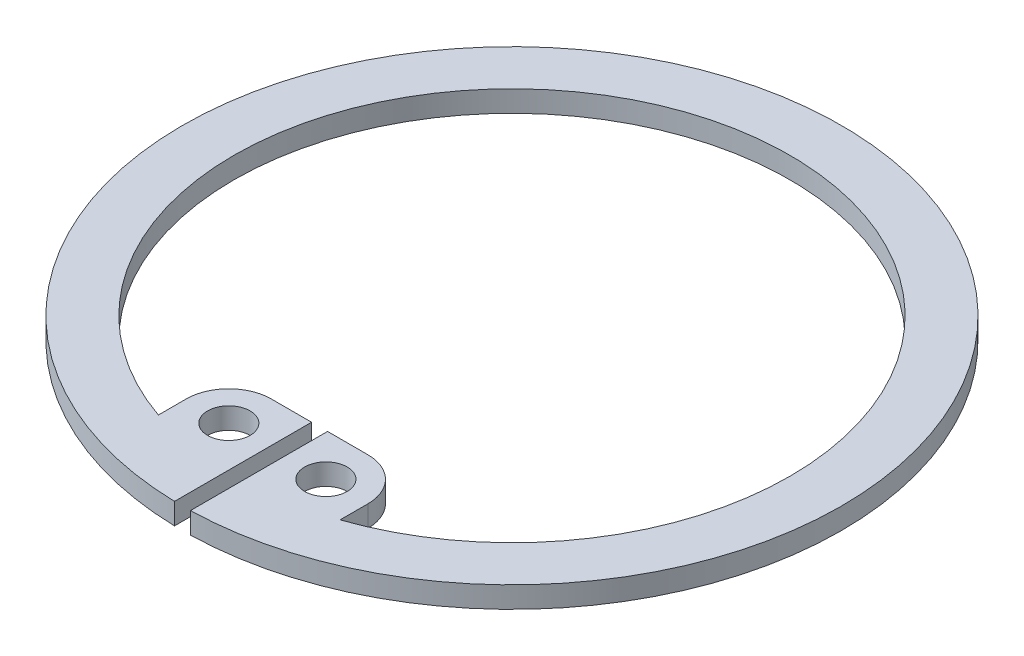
ISO-10303-21;
HEADER;
FILE_DESCRIPTION(('STEP AP214'),'2;1');
FILE_NAME('part.step','',(''),(''),'','','');
FILE_SCHEMA(('AUTOMOTIVE_DESIGN { 1 0 10303 214 1 1 1 1 }'));
ENDSEC;
DATA;
#1=APPLICATION_CONTEXT('core data for automotive mechanical design processes');
#2=APPLICATION_PROTOCOL_DEFINITION('international standard','automotive_design',2000,#1);
#3=PRODUCT_CONTEXT('',#1,'mechanical');
#4=PRODUCT('Part','Part','',(#3));
#5=PRODUCT_RELATED_PRODUCT_CATEGORY('part','',(#4));
#6=PRODUCT_DEFINITION_FORMATION('','',#4);
#7=PRODUCT_DEFINITION_CONTEXT('part definition',#1,'design');
#8=PRODUCT_DEFINITION('design','',#6,#7);
#9=PRODUCT_DEFINITION_SHAPE('','',#8);
#10=(LENGTH_UNIT() NAMED_UNIT(*) SI_UNIT(.MILLI.,.METRE.));
#11=(NAMED_UNIT(*) PLANE_ANGLE_UNIT() SI_UNIT($,.RADIAN.));
#12=(NAMED_UNIT(*) SI_UNIT($,.STERADIAN.) SOLID_ANGLE_UNIT());
#13=UNCERTAINTY_MEASURE_WITH_UNIT(LENGTH_MEASURE(1.E-05),#10,'distance_accuracy_value','');
#14=(GEOMETRIC_REPRESENTATION_CONTEXT(3) GLOBAL_UNCERTAINTY_ASSIGNED_CONTEXT((#13)) GLOBAL_UNIT_ASSIGNED_CONTEXT((#10,
#11,#12)) REPRESENTATION_CONTEXT('',''));
#15=CARTESIAN_POINT('',(0.,0.,0.));
#16=DIRECTION('',(0.,0.,1.));
#17=DIRECTION('',(1.,0.,0.));
#18=AXIS2_PLACEMENT_3D('',#15,#16,#17);
#19=CARTESIAN_POINT('',(0.,4.,0.));
#20=DIRECTION('',(0.,1.,0.));
#21=DIRECTION('',(0.,0.,1.));
#22=AXIS2_PLACEMENT_3D('',#19,#20,#21);
#23=PLANE('',#22);
#24=CARTESIAN_POINT('',(9.13387792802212,4.,44.1290912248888));
#25=DIRECTION('',(0.,1.,0.));
#26=DIRECTION('',(0.,0.,-1.));
#27=AXIS2_PLACEMENT_3D('',#24,#25,#26);
#28=CIRCLE('',#27,4.);
#29=CARTESIAN_POINT('',(9.13387792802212,4.,40.1290912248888));
#30=VERTEX_POINT('',#29);
#31=EDGE_CURVE('E152',#30,#30,#28,.T.);
#32=ORIENTED_EDGE('',*,*,#31,.F.);
#33=EDGE_LOOP('',(#32));
#34=FACE_BOUND('',#33,.T.);
#35=DIRECTION('',(0.,0.,-1.));
#36=VECTOR('',#35,1.);
#37=CARTESIAN_POINT('',(17.086811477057,4.,49.4300604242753));
#38=LINE('',#37,#36);
#39=CARTESIAN_POINT('',(17.086811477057,4.,49.4300604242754));
#40=VERTEX_POINT('',#39);
#41=CARTESIAN_POINT('',(17.086811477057,4.,44.1930357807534));
#42=VERTEX_POINT('',#41);
#43=EDGE_CURVE('E120',#40,#42,#38,.T.);
#44=ORIENTED_EDGE('',*,*,#43,.T.);
#45=CARTESIAN_POINT('',(9.08681147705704,4.,44.1930357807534));
#46=DIRECTION('',(0.,1.,0.));
#47=DIRECTION('',(0.,0.,1.));
#48=AXIS2_PLACEMENT_3D('',#45,#46,#47);
#49=CIRCLE('',#48,8.);
#50=CARTESIAN_POINT('',(9.08681147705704,4.,36.1930357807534));
#51=VERTEX_POINT('',#50);
#52=EDGE_CURVE('E116',#42,#51,#49,.T.);
#53=ORIENTED_EDGE('',*,*,#52,.T.);
#54=DIRECTION('',(-1.,0.,0.));
#55=VECTOR('',#54,1.);
#56=CARTESIAN_POINT('',(17.086811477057,4.,36.1930357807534));
#57=LINE('',#56,#55);
#58=CARTESIAN_POINT('',(1.49999999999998,4.,36.1930357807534));
#59=VERTEX_POINT('',#58);
#60=EDGE_CURVE('E108',#51,#59,#57,.T.);
#61=ORIENTED_EDGE('',*,*,#60,.T.);
#62=DIRECTION('',(0.,0.,1.));
#63=VECTOR('',#62,1.);
#64=CARTESIAN_POINT('',(1.49999999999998,4.,61.9818521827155));
#65=LINE('',#64,#63);
#66=CARTESIAN_POINT('',(1.49999999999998,4.,61.9818521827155));
#67=VERTEX_POINT('',#66);
#68=EDGE_CURVE('E113',#59,#67,#65,.T.);
#69=ORIENTED_EDGE('',*,*,#68,.T.);
#70=CARTESIAN_POINT('',(0.,4.,0.));
#71=DIRECTION('',(0.,1.,0.));
#72=DIRECTION('',(0.,0.,1.));
#73=AXIS2_PLACEMENT_3D('',#70,#71,#72);
#74=CIRCLE('',#73,62.);
#75=CARTESIAN_POINT('',(-1.5,4.,61.9818521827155));
#76=VERTEX_POINT('',#75);
#77=EDGE_CURVE('E135',#67,#76,#74,.T.);
#78=ORIENTED_EDGE('',*,*,#77,.T.);
#79=DIRECTION('',(0.,0.,-1.));
#80=VECTOR('',#79,1.);
#81=CARTESIAN_POINT('',(-1.49999999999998,4.,61.9818521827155));
#82=LINE('',#81,#80);
#83=CARTESIAN_POINT('',(-1.49999999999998,4.,36.1930357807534));
#84=VERTEX_POINT('',#83);
#85=EDGE_CURVE('E137',#76,#84,#82,.T.);
#86=ORIENTED_EDGE('',*,*,#85,.T.);
#87=DIRECTION('',(-1.,0.,0.));
#88=VECTOR('',#87,1.);
#89=CARTESIAN_POINT('',(-17.086811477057,4.,36.1930357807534));
#90=LINE('',#89,#88);
#91=CARTESIAN_POINT('',(-9.08681147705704,4.,36.1930357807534));
#92=VERTEX_POINT('',#91);
#93=EDGE_CURVE('E142',#84,#92,#90,.T.);
#94=ORIENTED_EDGE('',*,*,#93,.T.);
#95=CARTESIAN_POINT('',(-9.08681147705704,4.,44.1930357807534));
#96=DIRECTION('',(0.,1.,0.));
#97=DIRECTION('',(0.,0.,1.));
#98=AXIS2_PLACEMENT_3D('',#95,#96,#97);
#99=CIRCLE('',#98,8.);
#100=CARTESIAN_POINT('',(-17.086811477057,4.,44.1930357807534));
#101=VERTEX_POINT('',#100);
#102=EDGE_CURVE('E48',#92,#101,#99,.T.);
#103=ORIENTED_EDGE('',*,*,#102,.T.);
#104=DIRECTION('',(0.,0.,1.));
#105=VECTOR('',#104,1.);
#106=CARTESIAN_POINT('',(-17.086811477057,4.,49.4300604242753));
#107=LINE('',#106,#105);
#108=CARTESIAN_POINT('',(-17.086811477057,4.,49.4300604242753));
#109=VERTEX_POINT('',#108);
#110=EDGE_CURVE('E144',#101,#109,#107,.T.);
#111=ORIENTED_EDGE('',*,*,#110,.T.);
#112=CARTESIAN_POINT('',(0.,4.,0.));
#113=DIRECTION('',(0.,-1.,0.));
#114=DIRECTION('',(0.,0.,1.));
#115=AXIS2_PLACEMENT_3D('',#112,#113,#114);
#116=CIRCLE('',#115,52.3);
#117=EDGE_CURVE('E146',#109,#40,#116,.T.);
#118=ORIENTED_EDGE('',*,*,#117,.T.);
#119=EDGE_LOOP('',(#44,#53,#61,#69,#78,#86,#94,#103,#111,#118));
#120=FACE_BOUND('',#119,.T.);
#121=CARTESIAN_POINT('',(-9.13387792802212,4.,44.1290912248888));
#122=DIRECTION('',(0.,1.,0.));
#123=DIRECTION('',(0.,0.,1.));
#124=AXIS2_PLACEMENT_3D('',#121,#122,#123);
#125=CIRCLE('',#124,4.00000000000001);
#126=CARTESIAN_POINT('',(-9.13387792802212,4.,48.1290912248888));
#127=VERTEX_POINT('',#126);
#128=EDGE_CURVE('E211',#127,#127,#125,.T.);
#129=ORIENTED_EDGE('',*,*,#128,.F.);
#130=EDGE_LOOP('',(#129));
#131=FACE_BOUND('',#130,.T.);
#132=ADVANCED_FACE('F33',(#34,#120,#131),#23,.T.);
#133=CARTESIAN_POINT('',(0.,0.,0.));
#134=DIRECTION('',(0.,1.,0.));
#135=DIRECTION('',(0.,0.,1.));
#136=AXIS2_PLACEMENT_3D('',#133,#134,#135);
#137=PLANE('',#136);
#138=CARTESIAN_POINT('',(9.13387792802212,0.,44.1290912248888));
#139=DIRECTION('',(0.,1.,0.));
#140=DIRECTION('',(0.,0.,-1.));
#141=AXIS2_PLACEMENT_3D('',#138,#139,#140);
#142=CIRCLE('',#141,4.);
#143=CARTESIAN_POINT('',(9.13387792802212,0.,40.1290912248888));
#144=VERTEX_POINT('',#143);
#145=EDGE_CURVE('E208',#144,#144,#142,.T.);
#146=ORIENTED_EDGE('',*,*,#145,.T.);
#147=EDGE_LOOP('',(#146));
#148=FACE_BOUND('',#147,.T.);
#149=DIRECTION('',(-1.,0.,0.));
#150=VECTOR('',#149,1.);
#151=CARTESIAN_POINT('',(17.086811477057,0.,36.1930357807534));
#152=LINE('',#151,#150);
#153=CARTESIAN_POINT('',(9.08681147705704,0.,36.1930357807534));
#154=VERTEX_POINT('',#153);
#155=CARTESIAN_POINT('',(1.49999999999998,0.,36.1930357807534));
#156=VERTEX_POINT('',#155);
#157=EDGE_CURVE('E126',#154,#156,#152,.T.);
#158=ORIENTED_EDGE('',*,*,#157,.F.);
#159=CARTESIAN_POINT('',(9.08681147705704,0.,44.1930357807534));
#160=DIRECTION('',(0.,1.,0.));
#161=DIRECTION('',(0.,0.,1.));
#162=AXIS2_PLACEMENT_3D('',#159,#160,#161);
#163=CIRCLE('',#162,8.);
#164=CARTESIAN_POINT('',(17.086811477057,0.,44.1930357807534));
#165=VERTEX_POINT('',#164);
#166=EDGE_CURVE('E181',#154,#165,#163,.F.);
#167=ORIENTED_EDGE('',*,*,#166,.T.);
#168=DIRECTION('',(0.,0.,-1.));
#169=VECTOR('',#168,1.);
#170=CARTESIAN_POINT('',(17.086811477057,0.,49.4300604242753));
#171=LINE('',#170,#169);
#172=CARTESIAN_POINT('',(17.086811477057,0.,49.4300604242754));
#173=VERTEX_POINT('',#172);
#174=EDGE_CURVE('E149',#173,#165,#171,.T.);
#175=ORIENTED_EDGE('',*,*,#174,.F.);
#176=CARTESIAN_POINT('',(0.,0.,0.));
#177=DIRECTION('',(0.,-1.,0.));
#178=DIRECTION('',(0.,0.,1.));
#179=AXIS2_PLACEMENT_3D('',#176,#177,#178);
#180=CIRCLE('',#179,52.3);
#181=CARTESIAN_POINT('',(-17.086811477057,0.,49.4300604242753));
#182=VERTEX_POINT('',#181);
#183=EDGE_CURVE('E164',#182,#173,#180,.T.);
#184=ORIENTED_EDGE('',*,*,#183,.F.);
#185=DIRECTION('',(0.,0.,1.));
#186=VECTOR('',#185,1.);
#187=CARTESIAN_POINT('',(-17.086811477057,0.,49.4300604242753));
#188=LINE('',#187,#186);
#189=CARTESIAN_POINT('',(-17.086811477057,0.,44.1930357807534));
#190=VERTEX_POINT('',#189);
#191=EDGE_CURVE('E162',#190,#182,#188,.T.);
#192=ORIENTED_EDGE('',*,*,#191,.F.);
#193=CARTESIAN_POINT('',(-9.08681147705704,0.,44.1930357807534));
#194=DIRECTION('',(0.,1.,0.));
#195=DIRECTION('',(0.,0.,1.));
#196=AXIS2_PLACEMENT_3D('',#193,#194,#195);
#197=CIRCLE('',#196,8.);
#198=CARTESIAN_POINT('',(-9.08681147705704,0.,36.1930357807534));
#199=VERTEX_POINT('',#198);
#200=EDGE_CURVE('E179',#190,#199,#197,.F.);
#201=ORIENTED_EDGE('',*,*,#200,.T.);
#202=DIRECTION('',(-1.,0.,0.));
#203=VECTOR('',#202,1.);
#204=CARTESIAN_POINT('',(-17.086811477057,0.,36.1930357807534));
#205=LINE('',#204,#203);
#206=CARTESIAN_POINT('',(-1.49999999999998,0.,36.1930357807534));
#207=VERTEX_POINT('',#206);
#208=EDGE_CURVE('E160',#207,#199,#205,.T.);
#209=ORIENTED_EDGE('',*,*,#208,.F.);
#210=DIRECTION('',(0.,0.,-1.));
#211=VECTOR('',#210,1.);
#212=CARTESIAN_POINT('',(-1.49999999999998,0.,61.9818521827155));
#213=LINE('',#212,#211);
#214=CARTESIAN_POINT('',(-1.5,0.,61.9818521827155));
#215=VERTEX_POINT('',#214);
#216=EDGE_CURVE('E158',#215,#207,#213,.T.);
#217=ORIENTED_EDGE('',*,*,#216,.F.);
#218=CARTESIAN_POINT('',(0.,0.,0.));
#219=DIRECTION('',(0.,1.,0.));
#220=DIRECTION('',(0.,0.,1.));
#221=AXIS2_PLACEMENT_3D('',#218,#219,#220);
#222=CIRCLE('',#221,62.);
#223=CARTESIAN_POINT('',(1.49999999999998,0.,61.9818521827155));
#224=VERTEX_POINT('',#223);
#225=EDGE_CURVE('E156',#224,#215,#222,.T.);
#226=ORIENTED_EDGE('',*,*,#225,.F.);
#227=DIRECTION('',(0.,0.,1.));
#228=VECTOR('',#227,1.);
#229=CARTESIAN_POINT('',(1.49999999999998,0.,61.9818521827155));
#230=LINE('',#229,#228);
#231=EDGE_CURVE('E154',#156,#224,#230,.T.);
#232=ORIENTED_EDGE('',*,*,#231,.F.);
#233=EDGE_LOOP('',(#158,#167,#175,#184,#192,#201,#209,#217,#226,#232));
#234=FACE_BOUND('',#233,.T.);
#235=CARTESIAN_POINT('',(-9.13387792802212,0.,44.1290912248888));
#236=DIRECTION('',(0.,1.,0.));
#237=DIRECTION('',(0.,0.,1.));
#238=AXIS2_PLACEMENT_3D('',#235,#236,#237);
#239=CIRCLE('',#238,4.00000000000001);
#240=CARTESIAN_POINT('',(-9.13387792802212,0.,48.1290912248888));
#241=VERTEX_POINT('',#240);
#242=EDGE_CURVE('E214',#241,#241,#239,.T.);
#243=ORIENTED_EDGE('',*,*,#242,.T.);
#244=EDGE_LOOP('',(#243));
#245=FACE_BOUND('',#244,.T.);
#246=ADVANCED_FACE('F195',(#148,#234,#245),#137,.F.);
#247=CARTESIAN_POINT('',(17.086811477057,4.,49.4300604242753));
#248=DIRECTION('',(-1.,0.,0.));
#249=DIRECTION('',(0.,0.,1.));
#250=AXIS2_PLACEMENT_3D('',#247,#248,#249);
#251=PLANE('',#250);
#252=ORIENTED_EDGE('',*,*,#174,.T.);
#253=DIRECTION('',(0.,-1.,0.));
#254=VECTOR('',#253,1.);
#255=CARTESIAN_POINT('',(17.086811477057,4.,44.1930357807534));
#256=LINE('',#255,#254);
#257=EDGE_CURVE('E183',#165,#42,#256,.F.);
#258=ORIENTED_EDGE('',*,*,#257,.T.);
#259=ORIENTED_EDGE('',*,*,#43,.F.);
#260=DIRECTION('',(0.,-1.,0.));
#261=VECTOR('',#260,1.);
#262=CARTESIAN_POINT('',(17.086811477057,4.,49.4300604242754));
#263=LINE('',#262,#261);
#264=EDGE_CURVE('E148',#40,#173,#263,.T.);
#265=ORIENTED_EDGE('',*,*,#264,.T.);
#266=EDGE_LOOP('',(#252,#258,#259,#265));
#267=FACE_BOUND('',#266,.T.);
#268=ADVANCED_FACE('F205',(#267),#251,.F.);
#269=CARTESIAN_POINT('',(17.086811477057,4.,36.1930357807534));
#270=DIRECTION('',(0.,0.,1.));
#271=DIRECTION('',(1.,0.,0.));
#272=AXIS2_PLACEMENT_3D('',#269,#270,#271);
#273=PLANE('',#272);
#274=ORIENTED_EDGE('',*,*,#60,.F.);
#275=DIRECTION('',(0.,-1.,0.));
#276=VECTOR('',#275,1.);
#277=CARTESIAN_POINT('',(9.08681147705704,4.,36.1930357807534));
#278=LINE('',#277,#276);
#279=EDGE_CURVE('E129',#51,#154,#278,.T.);
#280=ORIENTED_EDGE('',*,*,#279,.T.);
#281=ORIENTED_EDGE('',*,*,#157,.T.);
#282=DIRECTION('',(0.,-1.,0.));
#283=VECTOR('',#282,1.);
#284=CARTESIAN_POINT('',(1.49999999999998,4.,36.1930357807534));
#285=LINE('',#284,#283);
#286=EDGE_CURVE('E123',#59,#156,#285,.T.);
#287=ORIENTED_EDGE('',*,*,#286,.F.);
#288=EDGE_LOOP('',(#274,#280,#281,#287));
#289=FACE_BOUND('',#288,.T.);
#290=ADVANCED_FACE('F124',(#289),#273,.F.);
#291=CARTESIAN_POINT('',(1.49999999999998,4.,61.9818521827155));
#292=DIRECTION('',(1.,0.,0.));
#293=DIRECTION('',(0.,0.,-1.));
#294=AXIS2_PLACEMENT_3D('',#291,#292,#293);
#295=PLANE('',#294);
#296=ORIENTED_EDGE('',*,*,#231,.T.);
#297=DIRECTION('',(0.,-1.,0.));
#298=VECTOR('',#297,1.);
#299=CARTESIAN_POINT('',(1.49999999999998,4.,61.9818521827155));
#300=LINE('',#299,#298);
#301=EDGE_CURVE('E130',#67,#224,#300,.T.);
#302=ORIENTED_EDGE('',*,*,#301,.F.);
#303=ORIENTED_EDGE('',*,*,#68,.F.);
#304=ORIENTED_EDGE('',*,*,#286,.T.);
#305=EDGE_LOOP('',(#296,#302,#303,#304));
#306=FACE_BOUND('',#305,.T.);
#307=ADVANCED_FACE('F132',(#306),#295,.F.);
#308=CARTESIAN_POINT('',(0.,4.,0.));
#309=DIRECTION('',(0.,-1.,0.));
#310=DIRECTION('',(0.,0.,-1.));
#311=AXIS2_PLACEMENT_3D('',#308,#309,#310);
#312=CYLINDRICAL_SURFACE('',#311,62.);
#313=ORIENTED_EDGE('',*,*,#225,.T.);
#314=DIRECTION('',(0.,-1.,0.));
#315=VECTOR('',#314,1.);
#316=CARTESIAN_POINT('',(-1.5,4.,61.9818521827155));
#317=LINE('',#316,#315);
#318=EDGE_CURVE('E174',#76,#215,#317,.T.);
#319=ORIENTED_EDGE('',*,*,#318,.F.);
#320=ORIENTED_EDGE('',*,*,#77,.F.);
#321=ORIENTED_EDGE('',*,*,#301,.T.);
#322=EDGE_LOOP('',(#313,#319,#320,#321));
#323=FACE_BOUND('',#322,.T.);
#324=ADVANCED_FACE('F245',(#323),#312,.T.);
#325=CARTESIAN_POINT('',(-1.49999999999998,4.,61.9818521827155));
#326=DIRECTION('',(-1.,0.,0.));
#327=DIRECTION('',(0.,0.,1.));
#328=AXIS2_PLACEMENT_3D('',#325,#326,#327);
#329=PLANE('',#328);
#330=ORIENTED_EDGE('',*,*,#216,.T.);
#331=DIRECTION('',(0.,-1.,0.));
#332=VECTOR('',#331,1.);
#333=CARTESIAN_POINT('',(-1.49999999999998,4.,36.1930357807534));
#334=LINE('',#333,#332);
#335=EDGE_CURVE('E171',#84,#207,#334,.T.);
#336=ORIENTED_EDGE('',*,*,#335,.F.);
#337=ORIENTED_EDGE('',*,*,#85,.F.);
#338=ORIENTED_EDGE('',*,*,#318,.T.);
#339=EDGE_LOOP('',(#330,#336,#337,#338));
#340=FACE_BOUND('',#339,.T.);
#341=ADVANCED_FACE('F242',(#340),#329,.F.);
#342=CARTESIAN_POINT('',(-17.086811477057,4.,36.1930357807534));
#343=DIRECTION('',(0.,0.,1.));
#344=DIRECTION('',(1.,0.,0.));
#345=AXIS2_PLACEMENT_3D('',#342,#343,#344);
#346=PLANE('',#345);
#347=ORIENTED_EDGE('',*,*,#208,.T.);
#348=DIRECTION('',(0.,-1.,0.));
#349=VECTOR('',#348,1.);
#350=CARTESIAN_POINT('',(-9.08681147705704,4.,36.1930357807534));
#351=LINE('',#350,#349);
#352=EDGE_CURVE('E11',#199,#92,#351,.F.);
#353=ORIENTED_EDGE('',*,*,#352,.T.);
#354=ORIENTED_EDGE('',*,*,#93,.F.);
#355=ORIENTED_EDGE('',*,*,#335,.T.);
#356=EDGE_LOOP('',(#347,#353,#354,#355));
#357=FACE_BOUND('',#356,.T.);
#358=ADVANCED_FACE('F239',(#357),#346,.F.);
#359=CARTESIAN_POINT('',(-17.086811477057,4.,49.4300604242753));
#360=DIRECTION('',(1.,0.,0.));
#361=DIRECTION('',(0.,0.,-1.));
#362=AXIS2_PLACEMENT_3D('',#359,#360,#361);
#363=PLANE('',#362);
#364=ORIENTED_EDGE('',*,*,#110,.F.);
#365=DIRECTION('',(0.,-1.,0.));
#366=VECTOR('',#365,1.);
#367=CARTESIAN_POINT('',(-17.086811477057,4.,44.1930357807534));
#368=LINE('',#367,#366);
#369=EDGE_CURVE('E41',#101,#190,#368,.T.);
#370=ORIENTED_EDGE('',*,*,#369,.T.);
#371=ORIENTED_EDGE('',*,*,#191,.T.);
#372=DIRECTION('',(0.,-1.,0.));
#373=VECTOR('',#372,1.);
#374=CARTESIAN_POINT('',(-17.086811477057,4.,49.4300604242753));
#375=LINE('',#374,#373);
#376=EDGE_CURVE('E168',#109,#182,#375,.T.);
#377=ORIENTED_EDGE('',*,*,#376,.F.);
#378=EDGE_LOOP('',(#364,#370,#371,#377));
#379=FACE_BOUND('',#378,.T.);
#380=ADVANCED_FACE('F190',(#379),#363,.F.);
#381=CARTESIAN_POINT('',(0.,4.,0.));
#382=DIRECTION('',(0.,-1.,0.));
#383=DIRECTION('',(0.,0.,-1.));
#384=AXIS2_PLACEMENT_3D('',#381,#382,#383);
#385=CYLINDRICAL_SURFACE('',#384,52.3);
#386=ORIENTED_EDGE('',*,*,#183,.T.);
#387=ORIENTED_EDGE('',*,*,#264,.F.);
#388=ORIENTED_EDGE('',*,*,#117,.F.);
#389=ORIENTED_EDGE('',*,*,#376,.T.);
#390=EDGE_LOOP('',(#386,#387,#388,#389));
#391=FACE_BOUND('',#390,.T.);
#392=ADVANCED_FACE('F201',(#391),#385,.F.);
#393=CARTESIAN_POINT('',(9.13387792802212,4.,44.1290912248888));
#394=DIRECTION('',(0.,-1.,0.));
#395=DIRECTION('',(0.,0.,-1.));
#396=AXIS2_PLACEMENT_3D('',#393,#394,#395);
#397=CYLINDRICAL_SURFACE('',#396,4.);
#398=ORIENTED_EDGE('',*,*,#31,.T.);
#399=EDGE_LOOP('',(#398));
#400=FACE_BOUND('',#399,.T.);
#401=ORIENTED_EDGE('',*,*,#145,.F.);
#402=EDGE_LOOP('',(#401));
#403=FACE_BOUND('',#402,.T.);
#404=ADVANCED_FACE('F232',(#400,#403),#397,.F.);
#405=CARTESIAN_POINT('',(-9.13387792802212,4.,44.1290912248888));
#406=DIRECTION('',(0.,-1.,0.));
#407=DIRECTION('',(0.,0.,-1.));
#408=AXIS2_PLACEMENT_3D('',#405,#406,#407);
#409=CYLINDRICAL_SURFACE('',#408,4.00000000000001);
#410=ORIENTED_EDGE('',*,*,#128,.T.);
#411=EDGE_LOOP('',(#410));
#412=FACE_BOUND('',#411,.T.);
#413=ORIENTED_EDGE('',*,*,#242,.F.);
#414=EDGE_LOOP('',(#413));
#415=FACE_BOUND('',#414,.T.);
#416=ADVANCED_FACE('F220',(#412,#415),#409,.F.);
#417=CARTESIAN_POINT('',(9.08681147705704,4.,44.1930357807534));
#418=DIRECTION('',(0.,-1.,0.));
#419=DIRECTION('',(0.,0.,-1.));
#420=AXIS2_PLACEMENT_3D('',#417,#418,#419);
#421=CYLINDRICAL_SURFACE('',#420,8.);
#422=ORIENTED_EDGE('',*,*,#52,.F.);
#423=ORIENTED_EDGE('',*,*,#257,.F.);
#424=ORIENTED_EDGE('',*,*,#166,.F.);
#425=ORIENTED_EDGE('',*,*,#279,.F.);
#426=EDGE_LOOP('',(#422,#423,#424,#425));
#427=FACE_BOUND('',#426,.T.);
#428=ADVANCED_FACE('F255',(#427),#421,.T.);
#429=CARTESIAN_POINT('',(-9.08681147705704,4.,44.1930357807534));
#430=DIRECTION('',(0.,-1.,0.));
#431=DIRECTION('',(0.,0.,-1.));
#432=AXIS2_PLACEMENT_3D('',#429,#430,#431);
#433=CYLINDRICAL_SURFACE('',#432,8.);
#434=ORIENTED_EDGE('',*,*,#102,.F.);
#435=ORIENTED_EDGE('',*,*,#352,.F.);
#436=ORIENTED_EDGE('',*,*,#200,.F.);
#437=ORIENTED_EDGE('',*,*,#369,.F.);
#438=EDGE_LOOP('',(#434,#435,#436,#437));
#439=FACE_BOUND('',#438,.T.);
#440=ADVANCED_FACE('F35',(#439),#433,.T.);
#441=CLOSED_SHELL('',(#132,#246,#268,#290,#307,#324,#341,#358,#380,#392,#404,#416,#428,#440));
#442=MANIFOLD_SOLID_BREP('B2',#441);
#443=ADVANCED_BREP_SHAPE_REPRESENTATION('',(#18,#442),#14);
#444=SHAPE_DEFINITION_REPRESENTATION(#9,#443);
ENDSEC;
END-ISO-10303-21;
